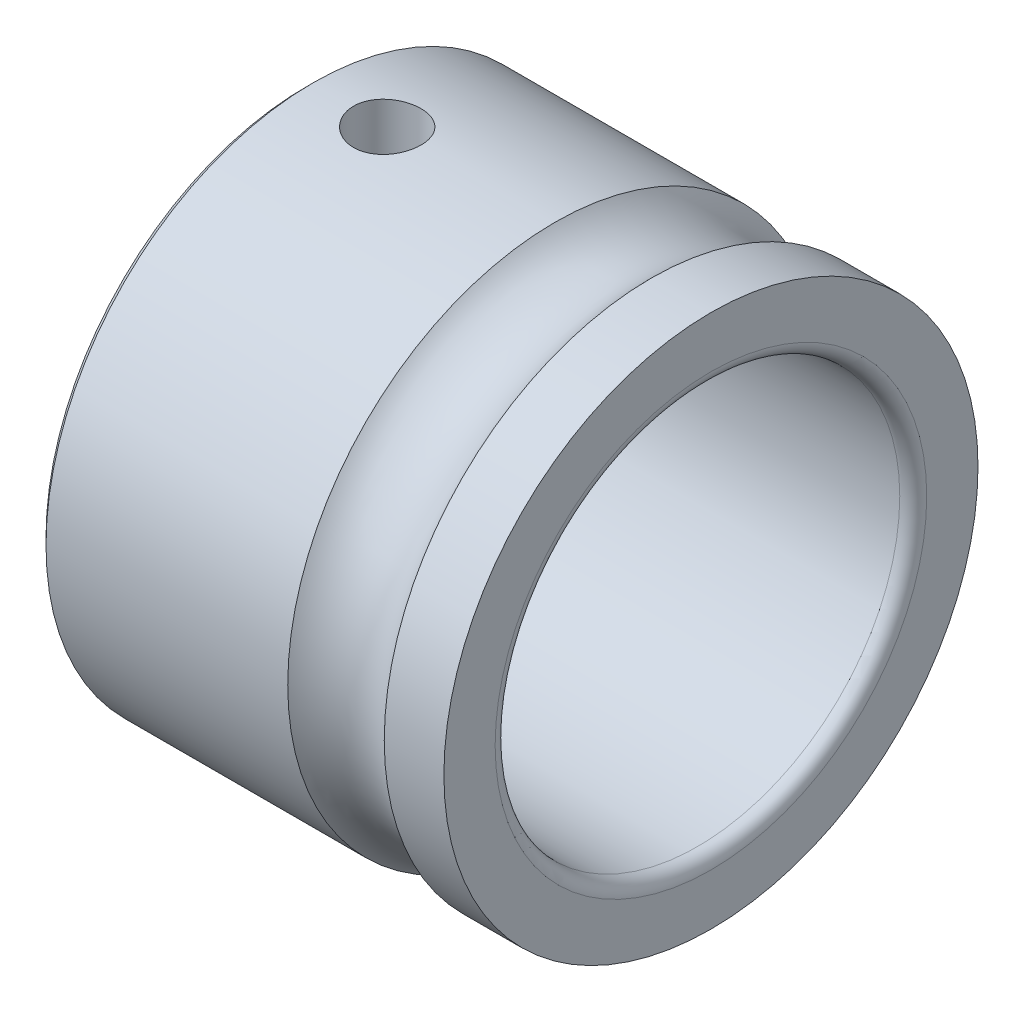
from build123d import *

# Parameters (mm, degrees)
EXTRUSION1_DEPTH             = 14
EXTRUSION1_DEPTH_BACK        = 2
ESQUISSE2_R                  = 19.8
ESQUISSE2_R_2                = 15
CONG_1_R                     = 1
CHANFREIN1_SIZE              = 0.5
ESQUISSE5_W                  = 2.5
ESQUISSE5_H                  = 19.8
R_P_TITION_CIRCULAIRE1_COUNT = 2
R_P_TITION_CIRCULAIRE1_ANGLE = 90


with BuildPart() as part:
    # Esquisse1 → Base-R_volution (revolve)
    with BuildSketch(Plane(origin=(0, 0, 0), x_dir=(1, 0, 0), z_dir=(0, 1, 0)), mode=Mode.PRIVATE) as base_r_volution_sk:
        with BuildLine():
            Line((0, 19.8), (0, 16))
            ThreePointArc((0, 16), (0.292893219, 15.292893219), (1, 15))
            Line((1, 15), (15, 15))
            ThreePointArc((15, 15), (15.707106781, 15.292893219), (16, 16))
            Line((16, 16), (16, 19.8))
            Line((16, 19.8), (11.577708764, 19.8))
            ThreePointArc((11.577708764, 19.8), (8, 18.2), (4.422291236, 19.8))
            Line((4.422291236, 19.8), (0, 19.8))
        make_face()
    revolve(base_r_volution_sk.sketch.rotate(Axis((0, 0, 0), (1, 0, 0)), 180), axis=Axis((0, 0, 0), (1, 0, 0)))

    # Esquisse2 → Extrusion1 (add, two sides: drawn at the far end of the back side and taken through both)
    with BuildSketch(Plane.ZY.offset(-EXTRUSION1_DEPTH_BACK)):
        Circle(ESQUISSE2_R)
        Circle(ESQUISSE2_R_2, mode=Mode.SUBTRACT)
    extrude(amount=EXTRUSION1_DEPTH + EXTRUSION1_DEPTH_BACK)

    # Cong_1
    cong_1_edges = [part.edges().sort_by_distance(p)[0] for p in [
        (-14, 0, -15),
    ]]
    fillet(cong_1_edges, radius=CONG_1_R)

    # Chanfrein1
    chanfrein1_edges = [part.edges().sort_by_distance(p)[0] for p in [
        (-14, 0, -19.8),
    ]]
    chamfer(chanfrein1_edges, length=CHANFREIN1_SIZE)

    # Esquisse5 → Trou taraud_ M61 (revolve, cut)
    with BuildSketch(Plane(origin=(-8, 0, 0), x_dir=(0, 0, -1), z_dir=(1, 0, 0))):
        with Locations((1.25, 9.9)):
            Rectangle(ESQUISSE5_W, ESQUISSE5_H)
    trou_taraud_m61 = revolve(axis=Axis((-8, -6.35, 0), (0, 1, 0)), mode=Mode.SUBTRACT)

    # R_p_tition circulaire1: Trou taraud_ M61 ×2 about axis
    r_p_tition_circulaire1_axis = Axis((15, 0, 0), (-1, 0, 0))
    for i in range(1, R_P_TITION_CIRCULAIRE1_COUNT):
        add(trou_taraud_m61.rotate(r_p_tition_circulaire1_axis, i * R_P_TITION_CIRCULAIRE1_ANGLE / (R_P_TITION_CIRCULAIRE1_COUNT - 1)), mode=Mode.SUBTRACT)


solid = part.part
